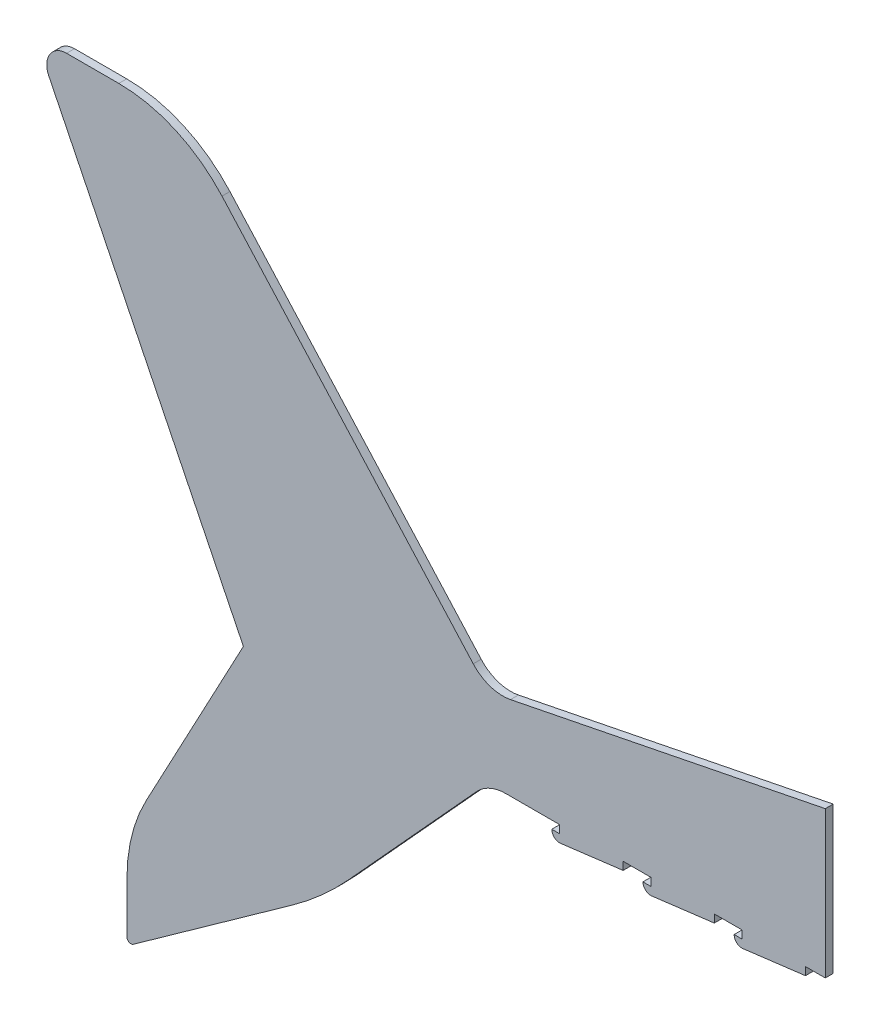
ISO-10303-21;
HEADER;
FILE_DESCRIPTION(('STEP AP214'),'2;1');
FILE_NAME('part.step','',(''),(''),'','','');
FILE_SCHEMA(('AUTOMOTIVE_DESIGN { 1 0 10303 214 1 1 1 1 }'));
ENDSEC;
DATA;
#1=APPLICATION_CONTEXT('core data for automotive mechanical design processes');
#2=APPLICATION_PROTOCOL_DEFINITION('international standard','automotive_design',2000,#1);
#3=PRODUCT_CONTEXT('',#1,'mechanical');
#4=PRODUCT('Part','Part','',(#3));
#5=PRODUCT_RELATED_PRODUCT_CATEGORY('part','',(#4));
#6=PRODUCT_DEFINITION_FORMATION('','',#4);
#7=PRODUCT_DEFINITION_CONTEXT('part definition',#1,'design');
#8=PRODUCT_DEFINITION('design','',#6,#7);
#9=PRODUCT_DEFINITION_SHAPE('','',#8);
#10=(LENGTH_UNIT() NAMED_UNIT(*) SI_UNIT(.MILLI.,.METRE.));
#11=(NAMED_UNIT(*) PLANE_ANGLE_UNIT() SI_UNIT($,.RADIAN.));
#12=(NAMED_UNIT(*) SI_UNIT($,.STERADIAN.) SOLID_ANGLE_UNIT());
#13=UNCERTAINTY_MEASURE_WITH_UNIT(LENGTH_MEASURE(1.E-05),#10,'distance_accuracy_value','');
#14=(GEOMETRIC_REPRESENTATION_CONTEXT(3) GLOBAL_UNCERTAINTY_ASSIGNED_CONTEXT((#13)) GLOBAL_UNIT_ASSIGNED_CONTEXT((#10,
#11,#12)) REPRESENTATION_CONTEXT('',''));
#15=CARTESIAN_POINT('',(0.,0.,0.));
#16=DIRECTION('',(0.,0.,1.));
#17=DIRECTION('',(1.,0.,0.));
#18=AXIS2_PLACEMENT_3D('',#15,#16,#17);
#19=CARTESIAN_POINT('',(0.,0.,2.));
#20=DIRECTION('',(0.,1.,0.));
#21=DIRECTION('',(0.,0.,1.));
#22=AXIS2_PLACEMENT_3D('',#19,#20,#21);
#23=PLANE('',#22);
#24=DIRECTION('',(0.,0.,1.));
#25=VECTOR('',#24,1.);
#26=CARTESIAN_POINT('',(-51.,0.,2.));
#27=LINE('',#26,#25);
#28=CARTESIAN_POINT('',(-51.,0.,0.));
#29=VERTEX_POINT('',#28);
#30=CARTESIAN_POINT('',(-51.,0.,2.));
#31=VERTEX_POINT('',#30);
#32=EDGE_CURVE('E318',#29,#31,#27,.T.);
#33=ORIENTED_EDGE('',*,*,#32,.F.);
#34=DIRECTION('',(1.,0.,0.));
#35=VECTOR('',#34,1.);
#36=CARTESIAN_POINT('',(0.,0.,0.));
#37=LINE('',#36,#35);
#38=CARTESIAN_POINT('',(-44.,0.,0.));
#39=VERTEX_POINT('',#38);
#40=EDGE_CURVE('E458',#29,#39,#37,.T.);
#41=ORIENTED_EDGE('',*,*,#40,.T.);
#42=DIRECTION('',(0.,0.,-1.));
#43=VECTOR('',#42,1.);
#44=CARTESIAN_POINT('',(-44.,0.,2.));
#45=LINE('',#44,#43);
#46=CARTESIAN_POINT('',(-44.,0.,2.));
#47=VERTEX_POINT('',#46);
#48=EDGE_CURVE('E343',#47,#39,#45,.T.);
#49=ORIENTED_EDGE('',*,*,#48,.F.);
#50=DIRECTION('',(1.,0.,0.));
#51=VECTOR('',#50,1.);
#52=CARTESIAN_POINT('',(0.,0.,2.));
#53=LINE('',#52,#51);
#54=EDGE_CURVE('E51',#31,#47,#53,.T.);
#55=ORIENTED_EDGE('',*,*,#54,.F.);
#56=EDGE_LOOP('',(#33,#41,#49,#55));
#57=FACE_BOUND('',#56,.T.);
#58=ADVANCED_FACE('F36',(#57),#23,.F.);
#59=DIRECTION('',(0.,0.,-1.));
#60=VECTOR('',#59,1.);
#61=CARTESIAN_POINT('',(-67.,0.,2.));
#62=LINE('',#61,#60);
#63=CARTESIAN_POINT('',(-67.,0.,2.));
#64=VERTEX_POINT('',#63);
#65=CARTESIAN_POINT('',(-67.,0.,0.));
#66=VERTEX_POINT('',#65);
#67=EDGE_CURVE('E59',#64,#66,#62,.T.);
#68=ORIENTED_EDGE('',*,*,#67,.F.);
#69=CARTESIAN_POINT('',(-80.5848116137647,0.,2.));
#70=VERTEX_POINT('',#69);
#71=EDGE_CURVE('E432',#70,#64,#53,.T.);
#72=ORIENTED_EDGE('',*,*,#71,.F.);
#73=DIRECTION('',(0.,0.,-1.));
#74=VECTOR('',#73,1.);
#75=CARTESIAN_POINT('',(-80.5848116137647,0.,0.));
#76=LINE('',#75,#74);
#77=CARTESIAN_POINT('',(-80.5848116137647,0.,0.));
#78=VERTEX_POINT('',#77);
#79=EDGE_CURVE('E467',#70,#78,#76,.T.);
#80=ORIENTED_EDGE('',*,*,#79,.T.);
#81=EDGE_CURVE('E412',#78,#66,#37,.T.);
#82=ORIENTED_EDGE('',*,*,#81,.T.);
#83=EDGE_LOOP('',(#68,#72,#80,#82));
#84=FACE_BOUND('',#83,.T.);
#85=ADVANCED_FACE('F595',(#84),#23,.F.);
#86=DIRECTION('',(0.,0.,1.));
#87=VECTOR('',#86,1.);
#88=CARTESIAN_POINT('',(-28.,0.,2.));
#89=LINE('',#88,#87);
#90=CARTESIAN_POINT('',(-28.,0.,0.));
#91=VERTEX_POINT('',#90);
#92=CARTESIAN_POINT('',(-28.,0.,2.));
#93=VERTEX_POINT('',#92);
#94=EDGE_CURVE('E338',#91,#93,#89,.T.);
#95=ORIENTED_EDGE('',*,*,#94,.F.);
#96=CARTESIAN_POINT('',(-21.,0.,0.));
#97=VERTEX_POINT('',#96);
#98=EDGE_CURVE('E631',#91,#97,#37,.T.);
#99=ORIENTED_EDGE('',*,*,#98,.T.);
#100=DIRECTION('',(0.,0.,-1.));
#101=VECTOR('',#100,1.);
#102=CARTESIAN_POINT('',(-21.,0.,2.));
#103=LINE('',#102,#101);
#104=CARTESIAN_POINT('',(-21.,0.,2.));
#105=VERTEX_POINT('',#104);
#106=EDGE_CURVE('E388',#105,#97,#103,.T.);
#107=ORIENTED_EDGE('',*,*,#106,.F.);
#108=EDGE_CURVE('E607',#93,#105,#53,.T.);
#109=ORIENTED_EDGE('',*,*,#108,.F.);
#110=EDGE_LOOP('',(#95,#99,#107,#109));
#111=FACE_BOUND('',#110,.T.);
#112=ADVANCED_FACE('F630',(#111),#23,.F.);
#113=DIRECTION('',(0.,0.,1.));
#114=VECTOR('',#113,1.);
#115=CARTESIAN_POINT('',(-5.,0.,2.));
#116=LINE('',#115,#114);
#117=CARTESIAN_POINT('',(-5.,0.,0.));
#118=VERTEX_POINT('',#117);
#119=CARTESIAN_POINT('',(-5.,0.,2.));
#120=VERTEX_POINT('',#119);
#121=EDGE_CURVE('E381',#118,#120,#116,.T.);
#122=ORIENTED_EDGE('',*,*,#121,.F.);
#123=CARTESIAN_POINT('',(0.,0.,0.));
#124=VERTEX_POINT('',#123);
#125=EDGE_CURVE('E456',#118,#124,#37,.T.);
#126=ORIENTED_EDGE('',*,*,#125,.T.);
#127=DIRECTION('',(0.,0.,-1.));
#128=VECTOR('',#127,1.);
#129=CARTESIAN_POINT('',(0.,0.,2.));
#130=LINE('',#129,#128);
#131=CARTESIAN_POINT('',(0.,0.,2.));
#132=VERTEX_POINT('',#131);
#133=EDGE_CURVE('E434',#132,#124,#130,.T.);
#134=ORIENTED_EDGE('',*,*,#133,.F.);
#135=EDGE_CURVE('E431',#120,#132,#53,.T.);
#136=ORIENTED_EDGE('',*,*,#135,.F.);
#137=EDGE_LOOP('',(#122,#126,#134,#136));
#138=FACE_BOUND('',#137,.T.);
#139=ADVANCED_FACE('F654',(#138),#23,.F.);
#140=CARTESIAN_POINT('',(0.,0.,2.));
#141=DIRECTION('',(-1.,0.,0.));
#142=DIRECTION('',(0.,0.,1.));
#143=AXIS2_PLACEMENT_3D('',#140,#141,#142);
#144=PLANE('',#143);
#145=DIRECTION('',(0.,1.,0.));
#146=VECTOR('',#145,1.);
#147=CARTESIAN_POINT('',(0.,0.,0.));
#148=LINE('',#147,#146);
#149=CARTESIAN_POINT('',(0.,37.,0.));
#150=VERTEX_POINT('',#149);
#151=EDGE_CURVE('E407',#124,#150,#148,.T.);
#152=ORIENTED_EDGE('',*,*,#151,.T.);
#153=DIRECTION('',(0.,0.,-1.));
#154=VECTOR('',#153,1.);
#155=CARTESIAN_POINT('',(0.,37.,2.));
#156=LINE('',#155,#154);
#157=CARTESIAN_POINT('',(0.,37.,2.));
#158=VERTEX_POINT('',#157);
#159=EDGE_CURVE('E464',#158,#150,#156,.T.);
#160=ORIENTED_EDGE('',*,*,#159,.F.);
#161=DIRECTION('',(0.,1.,0.));
#162=VECTOR('',#161,1.);
#163=CARTESIAN_POINT('',(0.,0.,2.));
#164=LINE('',#163,#162);
#165=EDGE_CURVE('E408',#132,#158,#164,.T.);
#166=ORIENTED_EDGE('',*,*,#165,.F.);
#167=ORIENTED_EDGE('',*,*,#133,.T.);
#168=EDGE_LOOP('',(#152,#160,#166,#167));
#169=FACE_BOUND('',#168,.T.);
#170=ADVANCED_FACE('F657',(#169),#144,.F.);
#171=CARTESIAN_POINT('',(0.,37.,2.));
#172=DIRECTION('',(0.196116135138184,-0.98058067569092,0.));
#173=DIRECTION('',(0.98058067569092,0.196116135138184,0.));
#174=AXIS2_PLACEMENT_3D('',#171,#172,#173);
#175=PLANE('',#174);
#176=DIRECTION('',(-0.98058067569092,-0.196116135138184,0.));
#177=VECTOR('',#176,1.);
#178=CARTESIAN_POINT('',(0.,37.,0.));
#179=LINE('',#178,#177);
#180=CARTESIAN_POINT('',(-79.4124927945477,21.1175014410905,0.));
#181=VERTEX_POINT('',#180);
#182=EDGE_CURVE('E437',#150,#181,#179,.T.);
#183=ORIENTED_EDGE('',*,*,#182,.T.);
#184=DIRECTION('',(0.,0.,-1.));
#185=VECTOR('',#184,1.);
#186=CARTESIAN_POINT('',(-79.4124927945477,21.1175014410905,2.));
#187=LINE('',#186,#185);
#188=CARTESIAN_POINT('',(-79.4124927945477,21.1175014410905,2.));
#189=VERTEX_POINT('',#188);
#190=EDGE_CURVE('E476',#181,#189,#187,.F.);
#191=ORIENTED_EDGE('',*,*,#190,.T.);
#192=DIRECTION('',(-0.98058067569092,-0.196116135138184,0.));
#193=VECTOR('',#192,1.);
#194=CARTESIAN_POINT('',(0.,37.,2.));
#195=LINE('',#194,#193);
#196=EDGE_CURVE('E411',#158,#189,#195,.T.);
#197=ORIENTED_EDGE('',*,*,#196,.F.);
#198=ORIENTED_EDGE('',*,*,#159,.T.);
#199=EDGE_LOOP('',(#183,#191,#197,#198));
#200=FACE_BOUND('',#199,.T.);
#201=ADVANCED_FACE('F659',(#200),#175,.F.);
#202=CARTESIAN_POINT('',(-162.616319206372,106.324126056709,2.));
#203=DIRECTION('',(-0.743616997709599,-0.668605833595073,0.));
#204=DIRECTION('',(0.668605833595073,-0.743616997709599,0.));
#205=AXIS2_PLACEMENT_3D('',#202,#203,#204);
#206=PLANE('',#205);
#207=DIRECTION('',(-0.668605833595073,0.743616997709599,0.));
#208=VECTOR('',#207,1.);
#209=CARTESIAN_POINT('',(-162.616319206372,106.324126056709,0.));
#210=LINE('',#209,#208);
#211=CARTESIAN_POINT('',(-88.8098241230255,24.2372498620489,0.));
#212=VERTEX_POINT('',#211);
#213=CARTESIAN_POINT('',(-152.187533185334,94.7253302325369,0.));
#214=VERTEX_POINT('',#213);
#215=EDGE_CURVE('E440',#212,#214,#210,.T.);
#216=ORIENTED_EDGE('',*,*,#215,.T.);
#217=DIRECTION('',(0.,0.,-1.));
#218=VECTOR('',#217,1.);
#219=CARTESIAN_POINT('',(-152.187533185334,94.7253302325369,2.));
#220=LINE('',#219,#218);
#221=CARTESIAN_POINT('',(-152.187533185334,94.7253302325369,2.));
#222=VERTEX_POINT('',#221);
#223=EDGE_CURVE('E44',#214,#222,#220,.F.);
#224=ORIENTED_EDGE('',*,*,#223,.T.);
#225=DIRECTION('',(-0.668605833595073,0.743616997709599,0.));
#226=VECTOR('',#225,1.);
#227=CARTESIAN_POINT('',(-162.616319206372,106.324126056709,2.));
#228=LINE('',#227,#226);
#229=CARTESIAN_POINT('',(-88.8098241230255,24.2372498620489,2.));
#230=VERTEX_POINT('',#229);
#231=EDGE_CURVE('E415',#230,#222,#228,.T.);
#232=ORIENTED_EDGE('',*,*,#231,.F.);
#233=DIRECTION('',(0.,0.,-1.));
#234=VECTOR('',#233,1.);
#235=CARTESIAN_POINT('',(-88.8098241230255,24.2372498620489,0.));
#236=LINE('',#235,#234);
#237=EDGE_CURVE('E473',#230,#212,#236,.T.);
#238=ORIENTED_EDGE('',*,*,#237,.T.);
#239=EDGE_LOOP('',(#216,#224,#232,#238));
#240=FACE_BOUND('',#239,.T.);
#241=ADVANCED_FACE('F536',(#240),#206,.F.);
#242=CARTESIAN_POINT('',(-199.407639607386,106.324126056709,2.));
#243=DIRECTION('',(0.,-1.,0.));
#244=DIRECTION('',(0.,0.,-1.));
#245=AXIS2_PLACEMENT_3D('',#242,#243,#244);
#246=PLANE('',#245);
#247=DIRECTION('',(-1.,0.,0.));
#248=VECTOR('',#247,1.);
#249=CARTESIAN_POINT('',(-199.407639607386,106.324126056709,2.));
#250=LINE('',#249,#248);
#251=CARTESIAN_POINT('',(-178.21412810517,106.324126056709,2.));
#252=VERTEX_POINT('',#251);
#253=CARTESIAN_POINT('',(-191.386050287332,106.324126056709,2.));
#254=VERTEX_POINT('',#253);
#255=EDGE_CURVE('E418',#252,#254,#250,.T.);
#256=ORIENTED_EDGE('',*,*,#255,.F.);
#257=DIRECTION('',(0.,0.,-1.));
#258=VECTOR('',#257,1.);
#259=CARTESIAN_POINT('',(-178.21412810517,106.324126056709,2.));
#260=LINE('',#259,#258);
#261=CARTESIAN_POINT('',(-178.21412810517,106.324126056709,0.));
#262=VERTEX_POINT('',#261);
#263=EDGE_CURVE('E529',#252,#262,#260,.T.);
#264=ORIENTED_EDGE('',*,*,#263,.T.);
#265=DIRECTION('',(-1.,0.,0.));
#266=VECTOR('',#265,1.);
#267=CARTESIAN_POINT('',(-199.407639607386,106.324126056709,0.));
#268=LINE('',#267,#266);
#269=CARTESIAN_POINT('',(-191.386050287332,106.324126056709,0.));
#270=VERTEX_POINT('',#269);
#271=EDGE_CURVE('E443',#262,#270,#268,.T.);
#272=ORIENTED_EDGE('',*,*,#271,.T.);
#273=DIRECTION('',(0.,0.,-1.));
#274=VECTOR('',#273,1.);
#275=CARTESIAN_POINT('',(-191.386050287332,106.324126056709,2.));
#276=LINE('',#275,#274);
#277=EDGE_CURVE('E524',#270,#254,#276,.F.);
#278=ORIENTED_EDGE('',*,*,#277,.T.);
#279=EDGE_LOOP('',(#256,#264,#272,#278));
#280=FACE_BOUND('',#279,.T.);
#281=ADVANCED_FACE('F547',(#280),#246,.F.);
#282=CARTESIAN_POINT('',(-146.787475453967,-0.954497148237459,2.));
#283=DIRECTION('',(0.897812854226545,0.440377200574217,0.));
#284=DIRECTION('',(-0.440377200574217,0.897812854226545,0.));
#285=AXIS2_PLACEMENT_3D('',#282,#283,#284);
#286=PLANE('',#285);
#287=DIRECTION('',(0.440377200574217,-0.897812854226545,0.));
#288=VECTOR('',#287,1.);
#289=CARTESIAN_POINT('',(-146.787475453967,-0.954497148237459,2.));
#290=LINE('',#289,#288);
#291=CARTESIAN_POINT('',(-195.875114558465,99.1222400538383,2.));
#292=VERTEX_POINT('',#291);
#293=CARTESIAN_POINT('',(-146.787475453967,-0.954497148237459,2.));
#294=VERTEX_POINT('',#293);
#295=EDGE_CURVE('E420',#292,#294,#290,.T.);
#296=ORIENTED_EDGE('',*,*,#295,.F.);
#297=DIRECTION('',(0.,0.,-1.));
#298=VECTOR('',#297,1.);
#299=CARTESIAN_POINT('',(-195.875114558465,99.1222400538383,2.));
#300=LINE('',#299,#298);
#301=CARTESIAN_POINT('',(-195.875114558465,99.1222400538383,0.));
#302=VERTEX_POINT('',#301);
#303=EDGE_CURVE('E518',#292,#302,#300,.T.);
#304=ORIENTED_EDGE('',*,*,#303,.T.);
#305=DIRECTION('',(0.440377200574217,-0.897812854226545,0.));
#306=VECTOR('',#305,1.);
#307=CARTESIAN_POINT('',(-146.787475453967,-0.954497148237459,0.));
#308=LINE('',#307,#306);
#309=CARTESIAN_POINT('',(-146.787475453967,-0.954497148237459,0.));
#310=VERTEX_POINT('',#309);
#311=EDGE_CURVE('E445',#302,#310,#308,.T.);
#312=ORIENTED_EDGE('',*,*,#311,.T.);
#313=DIRECTION('',(0.,0.,-1.));
#314=VECTOR('',#313,1.);
#315=CARTESIAN_POINT('',(-146.787475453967,-0.954497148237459,2.));
#316=LINE('',#315,#314);
#317=EDGE_CURVE('E461',#294,#310,#316,.T.);
#318=ORIENTED_EDGE('',*,*,#317,.F.);
#319=EDGE_LOOP('',(#296,#304,#312,#318));
#320=FACE_BOUND('',#319,.T.);
#321=ADVANCED_FACE('F558',(#320),#286,.F.);
#322=CARTESIAN_POINT('',(-176.155561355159,-55.9797070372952,2.));
#323=DIRECTION('',(0.882211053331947,-0.470854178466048,0.));
#324=DIRECTION('',(0.470854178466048,0.882211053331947,0.));
#325=AXIS2_PLACEMENT_3D('',#322,#323,#324);
#326=PLANE('',#325);
#327=DIRECTION('',(-0.470854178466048,-0.882211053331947,0.));
#328=VECTOR('',#327,1.);
#329=CARTESIAN_POINT('',(-176.155561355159,-55.9797070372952,0.));
#330=LINE('',#329,#328);
#331=CARTESIAN_POINT('',(-171.326214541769,-46.9312514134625,0.));
#332=VERTEX_POINT('',#331);
#333=EDGE_CURVE('E447',#310,#332,#330,.T.);
#334=ORIENTED_EDGE('',*,*,#333,.T.);
#335=DIRECTION('',(0.,0.,-1.));
#336=VECTOR('',#335,1.);
#337=CARTESIAN_POINT('',(-171.326214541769,-46.9312514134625,2.));
#338=LINE('',#337,#336);
#339=CARTESIAN_POINT('',(-171.326214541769,-46.9312514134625,2.));
#340=VERTEX_POINT('',#339);
#341=EDGE_CURVE('E514',#332,#340,#338,.F.);
#342=ORIENTED_EDGE('',*,*,#341,.T.);
#343=DIRECTION('',(-0.470854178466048,-0.882211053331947,0.));
#344=VECTOR('',#343,1.);
#345=CARTESIAN_POINT('',(-176.155561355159,-55.9797070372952,2.));
#346=LINE('',#345,#344);
#347=EDGE_CURVE('E422',#294,#340,#346,.T.);
#348=ORIENTED_EDGE('',*,*,#347,.F.);
#349=ORIENTED_EDGE('',*,*,#317,.T.);
#350=EDGE_LOOP('',(#334,#342,#348,#349));
#351=FACE_BOUND('',#350,.T.);
#352=ADVANCED_FACE('F561',(#351),#326,.F.);
#353=CARTESIAN_POINT('',(-176.155561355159,-81.0576783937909,2.));
#354=DIRECTION('',(1.,0.,0.));
#355=DIRECTION('',(0.,0.,-1.));
#356=AXIS2_PLACEMENT_3D('',#353,#354,#355);
#357=PLANE('',#356);
#358=DIRECTION('',(0.,-1.,0.));
#359=VECTOR('',#358,1.);
#360=CARTESIAN_POINT('',(-176.155561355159,-81.0576783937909,2.));
#361=LINE('',#360,#359);
#362=CARTESIAN_POINT('',(-176.155561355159,-66.2362727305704,2.));
#363=VERTEX_POINT('',#362);
#364=CARTESIAN_POINT('',(-176.155561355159,-79.1155731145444,2.));
#365=VERTEX_POINT('',#364);
#366=EDGE_CURVE('E425',#363,#365,#361,.T.);
#367=ORIENTED_EDGE('',*,*,#366,.F.);
#368=DIRECTION('',(0.,0.,-1.));
#369=VECTOR('',#368,1.);
#370=CARTESIAN_POINT('',(-176.155561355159,-66.2362727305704,2.));
#371=LINE('',#370,#369);
#372=CARTESIAN_POINT('',(-176.155561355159,-66.2362727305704,0.));
#373=VERTEX_POINT('',#372);
#374=EDGE_CURVE('E509',#363,#373,#371,.T.);
#375=ORIENTED_EDGE('',*,*,#374,.T.);
#376=DIRECTION('',(0.,-1.,0.));
#377=VECTOR('',#376,1.);
#378=CARTESIAN_POINT('',(-176.155561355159,-81.0576783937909,0.));
#379=LINE('',#378,#377);
#380=CARTESIAN_POINT('',(-176.155561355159,-79.1155731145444,0.));
#381=VERTEX_POINT('',#380);
#382=EDGE_CURVE('E450',#373,#381,#379,.T.);
#383=ORIENTED_EDGE('',*,*,#382,.T.);
#384=DIRECTION('',(0.,0.,-1.));
#385=VECTOR('',#384,1.);
#386=CARTESIAN_POINT('',(-176.155561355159,-79.1155731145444,2.));
#387=LINE('',#386,#385);
#388=EDGE_CURVE('E504',#381,#365,#387,.F.);
#389=ORIENTED_EDGE('',*,*,#388,.T.);
#390=EDGE_LOOP('',(#367,#375,#383,#389));
#391=FACE_BOUND('',#390,.T.);
#392=ADVANCED_FACE('F570',(#391),#357,.F.);
#393=CARTESIAN_POINT('',(-126.770997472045,-45.8168502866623,2.));
#394=DIRECTION('',(-0.58086857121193,0.813997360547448,0.));
#395=DIRECTION('',(-0.813997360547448,-0.58086857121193,0.));
#396=AXIS2_PLACEMENT_3D('',#393,#394,#395);
#397=PLANE('',#396);
#398=DIRECTION('',(0.813997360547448,0.58086857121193,0.));
#399=VECTOR('',#398,1.);
#400=CARTESIAN_POINT('',(-126.770997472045,-45.8168502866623,2.));
#401=LINE('',#400,#399);
#402=CARTESIAN_POINT('',(-174.574692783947,-79.9295704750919,2.));
#403=VERTEX_POINT('',#402);
#404=CARTESIAN_POINT('',(-134.556930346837,-51.3728925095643,2.));
#405=VERTEX_POINT('',#404);
#406=EDGE_CURVE('E427',#403,#405,#401,.T.);
#407=ORIENTED_EDGE('',*,*,#406,.F.);
#408=DIRECTION('',(0.,0.,-1.));
#409=VECTOR('',#408,1.);
#410=CARTESIAN_POINT('',(-174.574692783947,-79.9295704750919,2.));
#411=LINE('',#410,#409);
#412=CARTESIAN_POINT('',(-174.574692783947,-79.9295704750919,0.));
#413=VERTEX_POINT('',#412);
#414=EDGE_CURVE('E498',#403,#413,#411,.T.);
#415=ORIENTED_EDGE('',*,*,#414,.T.);
#416=DIRECTION('',(0.813997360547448,0.58086857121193,0.));
#417=VECTOR('',#416,1.);
#418=CARTESIAN_POINT('',(-126.770997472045,-45.8168502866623,0.));
#419=LINE('',#418,#417);
#420=CARTESIAN_POINT('',(-134.556930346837,-51.3728925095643,0.));
#421=VERTEX_POINT('',#420);
#422=EDGE_CURVE('E452',#413,#421,#419,.T.);
#423=ORIENTED_EDGE('',*,*,#422,.T.);
#424=DIRECTION('',(0.,0.,-1.));
#425=VECTOR('',#424,1.);
#426=CARTESIAN_POINT('',(-134.556930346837,-51.3728925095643,2.));
#427=LINE('',#426,#425);
#428=EDGE_CURVE('E493',#421,#405,#427,.F.);
#429=ORIENTED_EDGE('',*,*,#428,.T.);
#430=EDGE_LOOP('',(#407,#415,#423,#429));
#431=FACE_BOUND('',#430,.T.);
#432=ADVANCED_FACE('F579',(#431),#397,.F.);
#433=CARTESIAN_POINT('',(-85.,0.,2.));
#434=DIRECTION('',(-0.738981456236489,0.673725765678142,0.));
#435=DIRECTION('',(-0.673725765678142,-0.738981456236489,0.));
#436=AXIS2_PLACEMENT_3D('',#433,#434,#435);
#437=PLANE('',#436);
#438=DIRECTION('',(0.673725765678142,0.738981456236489,0.));
#439=VECTOR('',#438,1.);
#440=CARTESIAN_POINT('',(-85.,0.,2.));
#441=LINE('',#440,#439);
#442=CARTESIAN_POINT('',(-120.326770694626,-38.7484489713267,2.));
#443=VERTEX_POINT('',#442);
#444=CARTESIAN_POINT('',(-87.9746261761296,-3.26274234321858,2.));
#445=VERTEX_POINT('',#444);
#446=EDGE_CURVE('E429',#443,#445,#441,.T.);
#447=ORIENTED_EDGE('',*,*,#446,.F.);
#448=DIRECTION('',(0.,0.,-1.));
#449=VECTOR('',#448,1.);
#450=CARTESIAN_POINT('',(-120.326770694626,-38.7484489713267,2.));
#451=LINE('',#450,#449);
#452=CARTESIAN_POINT('',(-120.326770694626,-38.7484489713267,0.));
#453=VERTEX_POINT('',#452);
#454=EDGE_CURVE('E487',#443,#453,#451,.T.);
#455=ORIENTED_EDGE('',*,*,#454,.T.);
#456=DIRECTION('',(0.673725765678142,0.738981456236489,0.));
#457=VECTOR('',#456,1.);
#458=CARTESIAN_POINT('',(-85.,0.,0.));
#459=LINE('',#458,#457);
#460=CARTESIAN_POINT('',(-87.9746261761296,-3.26274234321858,0.));
#461=VERTEX_POINT('',#460);
#462=EDGE_CURVE('E454',#453,#461,#459,.T.);
#463=ORIENTED_EDGE('',*,*,#462,.T.);
#464=DIRECTION('',(0.,0.,-1.));
#465=VECTOR('',#464,1.);
#466=CARTESIAN_POINT('',(-87.9746261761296,-3.26274234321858,2.));
#467=LINE('',#466,#465);
#468=EDGE_CURVE('E470',#461,#445,#467,.F.);
#469=ORIENTED_EDGE('',*,*,#468,.T.);
#470=EDGE_LOOP('',(#447,#455,#463,#469));
#471=FACE_BOUND('',#470,.T.);
#472=ADVANCED_FACE('F587',(#471),#437,.F.);
#473=CARTESIAN_POINT('',(0.,0.,2.));
#474=DIRECTION('',(0.,0.,-1.));
#475=DIRECTION('',(-1.,0.,0.));
#476=AXIS2_PLACEMENT_3D('',#473,#474,#475);
#477=PLANE('',#476);
#478=ORIENTED_EDGE('',*,*,#231,.T.);
#479=CARTESIAN_POINT('',(-178.21412810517,71.3241260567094,2.));
#480=DIRECTION('',(0.,0.,-1.));
#481=DIRECTION('',(-1.,0.,0.));
#482=AXIS2_PLACEMENT_3D('',#479,#480,#481);
#483=CIRCLE('',#482,35.);
#484=EDGE_CURVE('E11',#222,#252,#483,.F.);
#485=ORIENTED_EDGE('',*,*,#484,.T.);
#486=ORIENTED_EDGE('',*,*,#255,.T.);
#487=CARTESIAN_POINT('',(-191.386050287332,101.324126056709,2.));
#488=DIRECTION('',(0.,0.,-1.));
#489=DIRECTION('',(-1.,0.,0.));
#490=AXIS2_PLACEMENT_3D('',#487,#488,#489);
#491=CIRCLE('',#490,5.);
#492=EDGE_CURVE('E527',#254,#292,#491,.F.);
#493=ORIENTED_EDGE('',*,*,#492,.T.);
#494=ORIENTED_EDGE('',*,*,#295,.T.);
#495=ORIENTED_EDGE('',*,*,#347,.T.);
#496=CARTESIAN_POINT('',(-135.155561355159,-66.2362727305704,2.));
#497=DIRECTION('',(0.,0.,-1.));
#498=DIRECTION('',(-1.,0.,0.));
#499=AXIS2_PLACEMENT_3D('',#496,#497,#498);
#500=CIRCLE('',#499,41.);
#501=EDGE_CURVE('E516',#340,#363,#500,.F.);
#502=ORIENTED_EDGE('',*,*,#501,.T.);
#503=ORIENTED_EDGE('',*,*,#366,.T.);
#504=CARTESIAN_POINT('',(-175.155561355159,-79.1155731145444,2.));
#505=DIRECTION('',(0.,0.,-1.));
#506=DIRECTION('',(-1.,0.,0.));
#507=AXIS2_PLACEMENT_3D('',#504,#505,#506);
#508=CIRCLE('',#507,1.);
#509=EDGE_CURVE('E507',#365,#403,#508,.F.);
#510=ORIENTED_EDGE('',*,*,#509,.T.);
#511=ORIENTED_EDGE('',*,*,#406,.T.);
#512=CARTESIAN_POINT('',(-186.83510175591,21.886869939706,2.));
#513=DIRECTION('',(0.,0.,-1.));
#514=DIRECTION('',(-1.,0.,0.));
#515=AXIS2_PLACEMENT_3D('',#512,#513,#514);
#516=CIRCLE('',#515,90.);
#517=EDGE_CURVE('E496',#405,#443,#516,.F.);
#518=ORIENTED_EDGE('',*,*,#517,.T.);
#519=ORIENTED_EDGE('',*,*,#446,.T.);
#520=CARTESIAN_POINT('',(-80.5848116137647,-10.,2.));
#521=DIRECTION('',(0.,0.,-1.));
#522=DIRECTION('',(-1.,0.,0.));
#523=AXIS2_PLACEMENT_3D('',#520,#521,#522);
#524=CIRCLE('',#523,10.);
#525=EDGE_CURVE('E481',#445,#70,#524,.T.);
#526=ORIENTED_EDGE('',*,*,#525,.T.);
#527=ORIENTED_EDGE('',*,*,#71,.T.);
#528=DIRECTION('',(0.,1.,0.));
#529=VECTOR('',#528,1.);
#530=CARTESIAN_POINT('',(-67.,-2.,2.));
#531=LINE('',#530,#529);
#532=CARTESIAN_POINT('',(-67.,-2.,2.));
#533=VERTEX_POINT('',#532);
#534=EDGE_CURVE('E333',#533,#64,#531,.T.);
#535=ORIENTED_EDGE('',*,*,#534,.F.);
#536=DIRECTION('',(-1.,0.,0.));
#537=VECTOR('',#536,1.);
#538=CARTESIAN_POINT('',(-46.,-2.,2.));
#539=LINE('',#538,#537);
#540=CARTESIAN_POINT('',(-69.,-2.,2.));
#541=VERTEX_POINT('',#540);
#542=EDGE_CURVE('E293',#533,#541,#539,.T.);
#543=ORIENTED_EDGE('',*,*,#542,.T.);
#544=CARTESIAN_POINT('',(-67.,-2.,2.));
#545=DIRECTION('',(0.,0.,1.));
#546=DIRECTION('',(1.,0.,0.));
#547=AXIS2_PLACEMENT_3D('',#544,#545,#546);
#548=CIRCLE('',#547,2.);
#549=CARTESIAN_POINT('',(-67.,-4.,2.));
#550=VERTEX_POINT('',#549);
#551=EDGE_CURVE('E283',#541,#550,#548,.T.);
#552=ORIENTED_EDGE('',*,*,#551,.T.);
#553=DIRECTION('',(0.992277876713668,0.124034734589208,0.));
#554=VECTOR('',#553,1.);
#555=CARTESIAN_POINT('',(-45.8307692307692,-1.35384615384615,2.));
#556=LINE('',#555,#554);
#557=CARTESIAN_POINT('',(-51.,-2.,2.));
#558=VERTEX_POINT('',#557);
#559=EDGE_CURVE('E276',#550,#558,#556,.T.);
#560=ORIENTED_EDGE('',*,*,#559,.T.);
#561=DIRECTION('',(0.,1.,0.));
#562=VECTOR('',#561,1.);
#563=CARTESIAN_POINT('',(-51.,-2.,2.));
#564=LINE('',#563,#562);
#565=EDGE_CURVE('E336',#558,#31,#564,.T.);
#566=ORIENTED_EDGE('',*,*,#565,.T.);
#567=ORIENTED_EDGE('',*,*,#54,.T.);
#568=DIRECTION('',(0.,1.,0.));
#569=VECTOR('',#568,1.);
#570=CARTESIAN_POINT('',(-44.,-2.,2.));
#571=LINE('',#570,#569);
#572=CARTESIAN_POINT('',(-44.,-2.,2.));
#573=VERTEX_POINT('',#572);
#574=EDGE_CURVE('E356',#573,#47,#571,.T.);
#575=ORIENTED_EDGE('',*,*,#574,.F.);
#576=DIRECTION('',(-1.,0.,0.));
#577=VECTOR('',#576,1.);
#578=CARTESIAN_POINT('',(-23.,-2.,2.));
#579=LINE('',#578,#577);
#580=CARTESIAN_POINT('',(-46.,-2.,2.));
#581=VERTEX_POINT('',#580);
#582=EDGE_CURVE('E298',#573,#581,#579,.T.);
#583=ORIENTED_EDGE('',*,*,#582,.T.);
#584=CARTESIAN_POINT('',(-44.,-2.,2.));
#585=DIRECTION('',(0.,0.,1.));
#586=DIRECTION('',(1.,0.,0.));
#587=AXIS2_PLACEMENT_3D('',#584,#585,#586);
#588=CIRCLE('',#587,2.);
#589=CARTESIAN_POINT('',(-44.,-4.,2.));
#590=VERTEX_POINT('',#589);
#591=EDGE_CURVE('E311',#581,#590,#588,.T.);
#592=ORIENTED_EDGE('',*,*,#591,.T.);
#593=DIRECTION('',(0.992277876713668,0.124034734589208,0.));
#594=VECTOR('',#593,1.);
#595=CARTESIAN_POINT('',(-22.8307692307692,-1.35384615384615,2.));
#596=LINE('',#595,#594);
#597=CARTESIAN_POINT('',(-28.,-2.,2.));
#598=VERTEX_POINT('',#597);
#599=EDGE_CURVE('E303',#590,#598,#596,.T.);
#600=ORIENTED_EDGE('',*,*,#599,.T.);
#601=DIRECTION('',(0.,1.,0.));
#602=VECTOR('',#601,1.);
#603=CARTESIAN_POINT('',(-28.,-2.,2.));
#604=LINE('',#603,#602);
#605=EDGE_CURVE('E359',#598,#93,#604,.T.);
#606=ORIENTED_EDGE('',*,*,#605,.T.);
#607=ORIENTED_EDGE('',*,*,#108,.T.);
#608=DIRECTION('',(0.,1.,0.));
#609=VECTOR('',#608,1.);
#610=CARTESIAN_POINT('',(-21.,-2.,2.));
#611=LINE('',#610,#609);
#612=CARTESIAN_POINT('',(-21.,-2.,2.));
#613=VERTEX_POINT('',#612);
#614=EDGE_CURVE('E401',#613,#105,#611,.T.);
#615=ORIENTED_EDGE('',*,*,#614,.F.);
#616=DIRECTION('',(-1.,0.,0.));
#617=VECTOR('',#616,1.);
#618=CARTESIAN_POINT('',(0.,-2.,2.));
#619=LINE('',#618,#617);
#620=CARTESIAN_POINT('',(-23.,-2.,2.));
#621=VERTEX_POINT('',#620);
#622=EDGE_CURVE('E362',#613,#621,#619,.T.);
#623=ORIENTED_EDGE('',*,*,#622,.T.);
#624=CARTESIAN_POINT('',(-21.,-2.,2.));
#625=DIRECTION('',(0.,0.,1.));
#626=DIRECTION('',(1.,0.,0.));
#627=AXIS2_PLACEMENT_3D('',#624,#625,#626);
#628=CIRCLE('',#627,2.);
#629=CARTESIAN_POINT('',(-21.,-4.,2.));
#630=VERTEX_POINT('',#629);
#631=EDGE_CURVE('E374',#621,#630,#628,.T.);
#632=ORIENTED_EDGE('',*,*,#631,.T.);
#633=DIRECTION('',(0.992277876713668,0.124034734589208,0.));
#634=VECTOR('',#633,1.);
#635=CARTESIAN_POINT('',(0.169230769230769,-1.35384615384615,2.));
#636=LINE('',#635,#634);
#637=CARTESIAN_POINT('',(-5.,-2.,2.));
#638=VERTEX_POINT('',#637);
#639=EDGE_CURVE('E366',#630,#638,#636,.T.);
#640=ORIENTED_EDGE('',*,*,#639,.T.);
#641=DIRECTION('',(0.,1.,0.));
#642=VECTOR('',#641,1.);
#643=CARTESIAN_POINT('',(-5.,-2.,2.));
#644=LINE('',#643,#642);
#645=EDGE_CURVE('E404',#638,#120,#644,.T.);
#646=ORIENTED_EDGE('',*,*,#645,.T.);
#647=ORIENTED_EDGE('',*,*,#135,.T.);
#648=ORIENTED_EDGE('',*,*,#165,.T.);
#649=ORIENTED_EDGE('',*,*,#196,.T.);
#650=CARTESIAN_POINT('',(-81.3736541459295,30.9233081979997,2.));
#651=DIRECTION('',(0.,0.,-1.));
#652=DIRECTION('',(-1.,0.,0.));
#653=AXIS2_PLACEMENT_3D('',#650,#651,#652);
#654=CIRCLE('',#653,10.);
#655=EDGE_CURVE('E485',#189,#230,#654,.T.);
#656=ORIENTED_EDGE('',*,*,#655,.T.);
#657=EDGE_LOOP('',(#478,#485,#486,#493,#494,#495,#502,#503,#510,#511,#518,#519,#526,#527,#535,
#543,#552,#560,#566,#567,#575,#583,#592,#600,#606,#607,#615,#623,#632,#640,#646,#647,#648,#649,#656));
#658=FACE_BOUND('',#657,.T.);
#659=ADVANCED_FACE('F542',(#658),#477,.F.);
#660=CARTESIAN_POINT('',(0.,0.,0.));
#661=DIRECTION('',(0.,0.,-1.));
#662=DIRECTION('',(-1.,0.,0.));
#663=AXIS2_PLACEMENT_3D('',#660,#661,#662);
#664=PLANE('',#663);
#665=ORIENTED_EDGE('',*,*,#271,.F.);
#666=CARTESIAN_POINT('',(-178.21412810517,71.3241260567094,0.));
#667=DIRECTION('',(0.,0.,-1.));
#668=DIRECTION('',(-1.,0.,0.));
#669=AXIS2_PLACEMENT_3D('',#666,#667,#668);
#670=CIRCLE('',#669,35.);
#671=EDGE_CURVE('E532',#262,#214,#670,.T.);
#672=ORIENTED_EDGE('',*,*,#671,.T.);
#673=ORIENTED_EDGE('',*,*,#215,.F.);
#674=CARTESIAN_POINT('',(-81.3736541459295,30.9233081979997,0.));
#675=DIRECTION('',(0.,0.,-1.));
#676=DIRECTION('',(-1.,0.,0.));
#677=AXIS2_PLACEMENT_3D('',#674,#675,#676);
#678=CIRCLE('',#677,10.);
#679=EDGE_CURVE('E483',#212,#181,#678,.F.);
#680=ORIENTED_EDGE('',*,*,#679,.T.);
#681=ORIENTED_EDGE('',*,*,#182,.F.);
#682=ORIENTED_EDGE('',*,*,#151,.F.);
#683=ORIENTED_EDGE('',*,*,#125,.F.);
#684=DIRECTION('',(0.,1.,0.));
#685=VECTOR('',#684,1.);
#686=CARTESIAN_POINT('',(-5.,-2.,0.));
#687=LINE('',#686,#685);
#688=CARTESIAN_POINT('',(-5.,-2.,0.));
#689=VERTEX_POINT('',#688);
#690=EDGE_CURVE('E391',#689,#118,#687,.T.);
#691=ORIENTED_EDGE('',*,*,#690,.F.);
#692=DIRECTION('',(0.992277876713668,0.124034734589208,0.));
#693=VECTOR('',#692,1.);
#694=CARTESIAN_POINT('',(0.169230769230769,-1.35384615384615,0.));
#695=LINE('',#694,#693);
#696=CARTESIAN_POINT('',(-21.,-4.,0.));
#697=VERTEX_POINT('',#696);
#698=EDGE_CURVE('E369',#697,#689,#695,.T.);
#699=ORIENTED_EDGE('',*,*,#698,.F.);
#700=CARTESIAN_POINT('',(-21.,-2.,0.));
#701=DIRECTION('',(0.,0.,1.));
#702=DIRECTION('',(1.,0.,0.));
#703=AXIS2_PLACEMENT_3D('',#700,#701,#702);
#704=CIRCLE('',#703,2.);
#705=CARTESIAN_POINT('',(-23.,-2.,0.));
#706=VERTEX_POINT('',#705);
#707=EDGE_CURVE('E365',#706,#697,#704,.T.);
#708=ORIENTED_EDGE('',*,*,#707,.F.);
#709=DIRECTION('',(-1.,0.,0.));
#710=VECTOR('',#709,1.);
#711=CARTESIAN_POINT('',(0.,-2.,0.));
#712=LINE('',#711,#710);
#713=CARTESIAN_POINT('',(-21.,-2.,0.));
#714=VERTEX_POINT('',#713);
#715=EDGE_CURVE('E363',#714,#706,#712,.T.);
#716=ORIENTED_EDGE('',*,*,#715,.F.);
#717=DIRECTION('',(0.,1.,0.));
#718=VECTOR('',#717,1.);
#719=CARTESIAN_POINT('',(-21.,-2.,0.));
#720=LINE('',#719,#718);
#721=EDGE_CURVE('E398',#714,#97,#720,.T.);
#722=ORIENTED_EDGE('',*,*,#721,.T.);
#723=ORIENTED_EDGE('',*,*,#98,.F.);
#724=DIRECTION('',(0.,1.,0.));
#725=VECTOR('',#724,1.);
#726=CARTESIAN_POINT('',(-28.,-2.,0.));
#727=LINE('',#726,#725);
#728=CARTESIAN_POINT('',(-28.,-2.,0.));
#729=VERTEX_POINT('',#728);
#730=EDGE_CURVE('E346',#729,#91,#727,.T.);
#731=ORIENTED_EDGE('',*,*,#730,.F.);
#732=DIRECTION('',(0.992277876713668,0.124034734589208,0.));
#733=VECTOR('',#732,1.);
#734=CARTESIAN_POINT('',(-22.8307692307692,-1.35384615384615,0.));
#735=LINE('',#734,#733);
#736=CARTESIAN_POINT('',(-44.,-4.,0.));
#737=VERTEX_POINT('',#736);
#738=EDGE_CURVE('E306',#737,#729,#735,.T.);
#739=ORIENTED_EDGE('',*,*,#738,.F.);
#740=CARTESIAN_POINT('',(-44.,-2.,0.));
#741=DIRECTION('',(0.,0.,1.));
#742=DIRECTION('',(1.,0.,0.));
#743=AXIS2_PLACEMENT_3D('',#740,#741,#742);
#744=CIRCLE('',#743,2.);
#745=CARTESIAN_POINT('',(-46.,-2.,0.));
#746=VERTEX_POINT('',#745);
#747=EDGE_CURVE('E302',#746,#737,#744,.T.);
#748=ORIENTED_EDGE('',*,*,#747,.F.);
#749=DIRECTION('',(-1.,0.,0.));
#750=VECTOR('',#749,1.);
#751=CARTESIAN_POINT('',(-23.,-2.,0.));
#752=LINE('',#751,#750);
#753=CARTESIAN_POINT('',(-44.,-2.,0.));
#754=VERTEX_POINT('',#753);
#755=EDGE_CURVE('E300',#754,#746,#752,.T.);
#756=ORIENTED_EDGE('',*,*,#755,.F.);
#757=DIRECTION('',(0.,1.,0.));
#758=VECTOR('',#757,1.);
#759=CARTESIAN_POINT('',(-44.,-2.,0.));
#760=LINE('',#759,#758);
#761=EDGE_CURVE('E353',#754,#39,#760,.T.);
#762=ORIENTED_EDGE('',*,*,#761,.T.);
#763=ORIENTED_EDGE('',*,*,#40,.F.);
#764=DIRECTION('',(0.,1.,0.));
#765=VECTOR('',#764,1.);
#766=CARTESIAN_POINT('',(-51.,-2.,0.));
#767=LINE('',#766,#765);
#768=CARTESIAN_POINT('',(-51.,-2.,0.));
#769=VERTEX_POINT('',#768);
#770=EDGE_CURVE('E325',#769,#29,#767,.T.);
#771=ORIENTED_EDGE('',*,*,#770,.F.);
#772=DIRECTION('',(0.992277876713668,0.124034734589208,0.));
#773=VECTOR('',#772,1.);
#774=CARTESIAN_POINT('',(-45.8307692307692,-1.35384615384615,0.));
#775=LINE('',#774,#773);
#776=CARTESIAN_POINT('',(-67.,-4.,0.));
#777=VERTEX_POINT('',#776);
#778=EDGE_CURVE('E285',#777,#769,#775,.T.);
#779=ORIENTED_EDGE('',*,*,#778,.F.);
#780=CARTESIAN_POINT('',(-67.,-2.,0.));
#781=DIRECTION('',(0.,0.,1.));
#782=DIRECTION('',(1.,0.,0.));
#783=AXIS2_PLACEMENT_3D('',#780,#781,#782);
#784=CIRCLE('',#783,2.);
#785=CARTESIAN_POINT('',(-69.,-2.,0.));
#786=VERTEX_POINT('',#785);
#787=EDGE_CURVE('E275',#786,#777,#784,.T.);
#788=ORIENTED_EDGE('',*,*,#787,.F.);
#789=DIRECTION('',(-1.,0.,0.));
#790=VECTOR('',#789,1.);
#791=CARTESIAN_POINT('',(-46.,-2.,0.));
#792=LINE('',#791,#790);
#793=CARTESIAN_POINT('',(-67.,-2.,0.));
#794=VERTEX_POINT('',#793);
#795=EDGE_CURVE('E265',#794,#786,#792,.T.);
#796=ORIENTED_EDGE('',*,*,#795,.F.);
#797=DIRECTION('',(0.,1.,0.));
#798=VECTOR('',#797,1.);
#799=CARTESIAN_POINT('',(-67.,-2.,0.));
#800=LINE('',#799,#798);
#801=EDGE_CURVE('E331',#794,#66,#800,.T.);
#802=ORIENTED_EDGE('',*,*,#801,.T.);
#803=ORIENTED_EDGE('',*,*,#81,.F.);
#804=CARTESIAN_POINT('',(-80.5848116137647,-10.,0.));
#805=DIRECTION('',(0.,0.,-1.));
#806=DIRECTION('',(-1.,0.,0.));
#807=AXIS2_PLACEMENT_3D('',#804,#805,#806);
#808=CIRCLE('',#807,10.);
#809=EDGE_CURVE('E478',#78,#461,#808,.F.);
#810=ORIENTED_EDGE('',*,*,#809,.T.);
#811=ORIENTED_EDGE('',*,*,#462,.F.);
#812=CARTESIAN_POINT('',(-186.83510175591,21.886869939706,0.));
#813=DIRECTION('',(0.,0.,-1.));
#814=DIRECTION('',(-1.,0.,0.));
#815=AXIS2_PLACEMENT_3D('',#812,#813,#814);
#816=CIRCLE('',#815,90.);
#817=EDGE_CURVE('E490',#453,#421,#816,.T.);
#818=ORIENTED_EDGE('',*,*,#817,.T.);
#819=ORIENTED_EDGE('',*,*,#422,.F.);
#820=CARTESIAN_POINT('',(-175.155561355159,-79.1155731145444,0.));
#821=DIRECTION('',(0.,0.,-1.));
#822=DIRECTION('',(-1.,0.,0.));
#823=AXIS2_PLACEMENT_3D('',#820,#821,#822);
#824=CIRCLE('',#823,1.);
#825=EDGE_CURVE('E501',#413,#381,#824,.T.);
#826=ORIENTED_EDGE('',*,*,#825,.T.);
#827=ORIENTED_EDGE('',*,*,#382,.F.);
#828=CARTESIAN_POINT('',(-135.155561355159,-66.2362727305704,0.));
#829=DIRECTION('',(0.,0.,-1.));
#830=DIRECTION('',(-1.,0.,0.));
#831=AXIS2_PLACEMENT_3D('',#828,#829,#830);
#832=CIRCLE('',#831,41.);
#833=EDGE_CURVE('E512',#373,#332,#832,.T.);
#834=ORIENTED_EDGE('',*,*,#833,.T.);
#835=ORIENTED_EDGE('',*,*,#333,.F.);
#836=ORIENTED_EDGE('',*,*,#311,.F.);
#837=CARTESIAN_POINT('',(-191.386050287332,101.324126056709,0.));
#838=DIRECTION('',(0.,0.,-1.));
#839=DIRECTION('',(-1.,0.,0.));
#840=AXIS2_PLACEMENT_3D('',#837,#838,#839);
#841=CIRCLE('',#840,5.);
#842=EDGE_CURVE('E521',#302,#270,#841,.T.);
#843=ORIENTED_EDGE('',*,*,#842,.T.);
#844=EDGE_LOOP('',(#665,#672,#673,#680,#681,#682,#683,#691,#699,#708,#716,#722,#723,#731,#739,
#748,#756,#762,#763,#771,#779,#788,#796,#802,#803,#810,#811,#818,#819,#826,#827,#834,#835,#836,#843));
#845=FACE_BOUND('',#844,.T.);
#846=ADVANCED_FACE('F288',(#845),#664,.T.);
#847=CARTESIAN_POINT('',(-80.5848116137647,-10.,2.));
#848=DIRECTION('',(0.,0.,1.));
#849=DIRECTION('',(1.,0.,0.));
#850=AXIS2_PLACEMENT_3D('',#847,#848,#849);
#851=CYLINDRICAL_SURFACE('',#850,10.);
#852=ORIENTED_EDGE('',*,*,#525,.F.);
#853=ORIENTED_EDGE('',*,*,#468,.F.);
#854=ORIENTED_EDGE('',*,*,#809,.F.);
#855=ORIENTED_EDGE('',*,*,#79,.F.);
#856=EDGE_LOOP('',(#852,#853,#854,#855));
#857=FACE_BOUND('',#856,.T.);
#858=ADVANCED_FACE('F593',(#857),#851,.F.);
#859=CARTESIAN_POINT('',(-81.3736541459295,30.9233081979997,2.));
#860=DIRECTION('',(0.,0.,1.));
#861=DIRECTION('',(1.,0.,0.));
#862=AXIS2_PLACEMENT_3D('',#859,#860,#861);
#863=CYLINDRICAL_SURFACE('',#862,10.);
#864=ORIENTED_EDGE('',*,*,#655,.F.);
#865=ORIENTED_EDGE('',*,*,#190,.F.);
#866=ORIENTED_EDGE('',*,*,#679,.F.);
#867=ORIENTED_EDGE('',*,*,#237,.F.);
#868=EDGE_LOOP('',(#864,#865,#866,#867));
#869=FACE_BOUND('',#868,.T.);
#870=ADVANCED_FACE('F662',(#869),#863,.F.);
#871=CARTESIAN_POINT('',(-186.83510175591,21.886869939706,2.));
#872=DIRECTION('',(0.,0.,-1.));
#873=DIRECTION('',(-1.,0.,0.));
#874=AXIS2_PLACEMENT_3D('',#871,#872,#873);
#875=CYLINDRICAL_SURFACE('',#874,90.);
#876=ORIENTED_EDGE('',*,*,#517,.F.);
#877=ORIENTED_EDGE('',*,*,#428,.F.);
#878=ORIENTED_EDGE('',*,*,#817,.F.);
#879=ORIENTED_EDGE('',*,*,#454,.F.);
#880=EDGE_LOOP('',(#876,#877,#878,#879));
#881=FACE_BOUND('',#880,.T.);
#882=ADVANCED_FACE('F584',(#881),#875,.T.);
#883=CARTESIAN_POINT('',(-175.155561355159,-79.1155731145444,2.));
#884=DIRECTION('',(0.,0.,-1.));
#885=DIRECTION('',(-1.,0.,0.));
#886=AXIS2_PLACEMENT_3D('',#883,#884,#885);
#887=CYLINDRICAL_SURFACE('',#886,1.);
#888=ORIENTED_EDGE('',*,*,#509,.F.);
#889=ORIENTED_EDGE('',*,*,#388,.F.);
#890=ORIENTED_EDGE('',*,*,#825,.F.);
#891=ORIENTED_EDGE('',*,*,#414,.F.);
#892=EDGE_LOOP('',(#888,#889,#890,#891));
#893=FACE_BOUND('',#892,.T.);
#894=ADVANCED_FACE('F576',(#893),#887,.T.);
#895=CARTESIAN_POINT('',(-135.155561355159,-66.2362727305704,2.));
#896=DIRECTION('',(0.,0.,-1.));
#897=DIRECTION('',(-1.,0.,0.));
#898=AXIS2_PLACEMENT_3D('',#895,#896,#897);
#899=CYLINDRICAL_SURFACE('',#898,41.);
#900=ORIENTED_EDGE('',*,*,#501,.F.);
#901=ORIENTED_EDGE('',*,*,#341,.F.);
#902=ORIENTED_EDGE('',*,*,#833,.F.);
#903=ORIENTED_EDGE('',*,*,#374,.F.);
#904=EDGE_LOOP('',(#900,#901,#902,#903));
#905=FACE_BOUND('',#904,.T.);
#906=ADVANCED_FACE('F567',(#905),#899,.T.);
#907=CARTESIAN_POINT('',(-191.386050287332,101.324126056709,2.));
#908=DIRECTION('',(0.,0.,-1.));
#909=DIRECTION('',(-1.,0.,0.));
#910=AXIS2_PLACEMENT_3D('',#907,#908,#909);
#911=CYLINDRICAL_SURFACE('',#910,5.);
#912=ORIENTED_EDGE('',*,*,#492,.F.);
#913=ORIENTED_EDGE('',*,*,#277,.F.);
#914=ORIENTED_EDGE('',*,*,#842,.F.);
#915=ORIENTED_EDGE('',*,*,#303,.F.);
#916=EDGE_LOOP('',(#912,#913,#914,#915));
#917=FACE_BOUND('',#916,.T.);
#918=ADVANCED_FACE('F554',(#917),#911,.T.);
#919=CARTESIAN_POINT('',(-178.21412810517,71.3241260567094,2.));
#920=DIRECTION('',(0.,0.,-1.));
#921=DIRECTION('',(-1.,0.,0.));
#922=AXIS2_PLACEMENT_3D('',#919,#920,#921);
#923=CYLINDRICAL_SURFACE('',#922,35.);
#924=ORIENTED_EDGE('',*,*,#484,.F.);
#925=ORIENTED_EDGE('',*,*,#223,.F.);
#926=ORIENTED_EDGE('',*,*,#671,.F.);
#927=ORIENTED_EDGE('',*,*,#263,.F.);
#928=EDGE_LOOP('',(#924,#925,#926,#927));
#929=FACE_BOUND('',#928,.T.);
#930=ADVANCED_FACE('F38',(#929),#923,.T.);
#931=CARTESIAN_POINT('',(-5.,-2.,2.));
#932=DIRECTION('',(-1.,0.,0.));
#933=DIRECTION('',(0.,0.,1.));
#934=AXIS2_PLACEMENT_3D('',#931,#932,#933);
#935=PLANE('',#934);
#936=ORIENTED_EDGE('',*,*,#121,.T.);
#937=ORIENTED_EDGE('',*,*,#645,.F.);
#938=DIRECTION('',(0.,0.,1.));
#939=VECTOR('',#938,1.);
#940=CARTESIAN_POINT('',(-5.,-2.,2.));
#941=LINE('',#940,#939);
#942=EDGE_CURVE('E384',#689,#638,#941,.T.);
#943=ORIENTED_EDGE('',*,*,#942,.F.);
#944=ORIENTED_EDGE('',*,*,#690,.T.);
#945=EDGE_LOOP('',(#936,#937,#943,#944));
#946=FACE_BOUND('',#945,.T.);
#947=ADVANCED_FACE('F648',(#946),#935,.F.);
#948=CARTESIAN_POINT('',(-21.,-2.,2.));
#949=DIRECTION('',(1.,0.,0.));
#950=DIRECTION('',(0.,0.,-1.));
#951=AXIS2_PLACEMENT_3D('',#948,#949,#950);
#952=PLANE('',#951);
#953=ORIENTED_EDGE('',*,*,#106,.T.);
#954=ORIENTED_EDGE('',*,*,#721,.F.);
#955=DIRECTION('',(0.,0.,-1.));
#956=VECTOR('',#955,1.);
#957=CARTESIAN_POINT('',(-21.,-2.,2.));
#958=LINE('',#957,#956);
#959=EDGE_CURVE('E387',#613,#714,#958,.T.);
#960=ORIENTED_EDGE('',*,*,#959,.F.);
#961=ORIENTED_EDGE('',*,*,#614,.T.);
#962=EDGE_LOOP('',(#953,#954,#960,#961));
#963=FACE_BOUND('',#962,.T.);
#964=ADVANCED_FACE('F633',(#963),#952,.F.);
#965=CARTESIAN_POINT('',(0.,-2.,0.));
#966=DIRECTION('',(0.,1.,0.));
#967=DIRECTION('',(-1.,0.,0.));
#968=AXIS2_PLACEMENT_3D('',#965,#966,#967);
#969=PLANE('',#968);
#970=ORIENTED_EDGE('',*,*,#959,.T.);
#971=ORIENTED_EDGE('',*,*,#715,.T.);
#972=DIRECTION('',(0.,0.,1.));
#973=VECTOR('',#972,1.);
#974=CARTESIAN_POINT('',(-23.,-2.,0.));
#975=LINE('',#974,#973);
#976=EDGE_CURVE('E372',#706,#621,#975,.T.);
#977=ORIENTED_EDGE('',*,*,#976,.T.);
#978=ORIENTED_EDGE('',*,*,#622,.F.);
#979=EDGE_LOOP('',(#970,#971,#977,#978));
#980=FACE_BOUND('',#979,.T.);
#981=ADVANCED_FACE('F636',(#980),#969,.T.);
#982=CARTESIAN_POINT('',(0.169230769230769,-1.35384615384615,0.));
#983=DIRECTION('',(0.124034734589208,-0.992277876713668,0.));
#984=DIRECTION('',(0.992277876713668,0.124034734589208,0.));
#985=AXIS2_PLACEMENT_3D('',#982,#983,#984);
#986=PLANE('',#985);
#987=ORIENTED_EDGE('',*,*,#639,.F.);
#988=DIRECTION('',(0.,0.,1.));
#989=VECTOR('',#988,1.);
#990=CARTESIAN_POINT('',(-21.,-4.,0.));
#991=LINE('',#990,#989);
#992=EDGE_CURVE('E379',#697,#630,#991,.T.);
#993=ORIENTED_EDGE('',*,*,#992,.F.);
#994=ORIENTED_EDGE('',*,*,#698,.T.);
#995=ORIENTED_EDGE('',*,*,#942,.T.);
#996=EDGE_LOOP('',(#987,#993,#994,#995));
#997=FACE_BOUND('',#996,.T.);
#998=ADVANCED_FACE('F645',(#997),#986,.T.);
#999=CARTESIAN_POINT('',(-21.,-2.,0.));
#1000=DIRECTION('',(0.,0.,1.));
#1001=DIRECTION('',(1.,0.,0.));
#1002=AXIS2_PLACEMENT_3D('',#999,#1000,#1001);
#1003=CYLINDRICAL_SURFACE('',#1002,2.);
#1004=ORIENTED_EDGE('',*,*,#631,.F.);
#1005=ORIENTED_EDGE('',*,*,#976,.F.);
#1006=ORIENTED_EDGE('',*,*,#707,.T.);
#1007=ORIENTED_EDGE('',*,*,#992,.T.);
#1008=EDGE_LOOP('',(#1004,#1005,#1006,#1007));
#1009=FACE_BOUND('',#1008,.T.);
#1010=ADVANCED_FACE('F642',(#1009),#1003,.T.);
#1011=CARTESIAN_POINT('',(-28.,-2.,2.));
#1012=DIRECTION('',(-1.,0.,0.));
#1013=DIRECTION('',(0.,0.,1.));
#1014=AXIS2_PLACEMENT_3D('',#1011,#1012,#1013);
#1015=PLANE('',#1014);
#1016=ORIENTED_EDGE('',*,*,#94,.T.);
#1017=ORIENTED_EDGE('',*,*,#605,.F.);
#1018=DIRECTION('',(0.,0.,1.));
#1019=VECTOR('',#1018,1.);
#1020=CARTESIAN_POINT('',(-28.,-2.,2.));
#1021=LINE('',#1020,#1019);
#1022=EDGE_CURVE('E339',#729,#598,#1021,.T.);
#1023=ORIENTED_EDGE('',*,*,#1022,.F.);
#1024=ORIENTED_EDGE('',*,*,#730,.T.);
#1025=EDGE_LOOP('',(#1016,#1017,#1023,#1024));
#1026=FACE_BOUND('',#1025,.T.);
#1027=ADVANCED_FACE('F624',(#1026),#1015,.F.);
#1028=CARTESIAN_POINT('',(-44.,-2.,2.));
#1029=DIRECTION('',(1.,0.,0.));
#1030=DIRECTION('',(0.,0.,-1.));
#1031=AXIS2_PLACEMENT_3D('',#1028,#1029,#1030);
#1032=PLANE('',#1031);
#1033=ORIENTED_EDGE('',*,*,#48,.T.);
#1034=ORIENTED_EDGE('',*,*,#761,.F.);
#1035=DIRECTION('',(0.,0.,-1.));
#1036=VECTOR('',#1035,1.);
#1037=CARTESIAN_POINT('',(-44.,-2.,2.));
#1038=LINE('',#1037,#1036);
#1039=EDGE_CURVE('E342',#573,#754,#1038,.T.);
#1040=ORIENTED_EDGE('',*,*,#1039,.F.);
#1041=ORIENTED_EDGE('',*,*,#574,.T.);
#1042=EDGE_LOOP('',(#1033,#1034,#1040,#1041));
#1043=FACE_BOUND('',#1042,.T.);
#1044=ADVANCED_FACE('F609',(#1043),#1032,.F.);
#1045=CARTESIAN_POINT('',(-51.,-2.,2.));
#1046=DIRECTION('',(-1.,0.,0.));
#1047=DIRECTION('',(0.,0.,1.));
#1048=AXIS2_PLACEMENT_3D('',#1045,#1046,#1047);
#1049=PLANE('',#1048);
#1050=ORIENTED_EDGE('',*,*,#32,.T.);
#1051=ORIENTED_EDGE('',*,*,#565,.F.);
#1052=DIRECTION('',(0.,0.,1.));
#1053=VECTOR('',#1052,1.);
#1054=CARTESIAN_POINT('',(-51.,-2.,2.));
#1055=LINE('',#1054,#1053);
#1056=EDGE_CURVE('E321',#769,#558,#1055,.T.);
#1057=ORIENTED_EDGE('',*,*,#1056,.F.);
#1058=ORIENTED_EDGE('',*,*,#770,.T.);
#1059=EDGE_LOOP('',(#1050,#1051,#1057,#1058));
#1060=FACE_BOUND('',#1059,.T.);
#1061=ADVANCED_FACE('F604',(#1060),#1049,.F.);
#1062=CARTESIAN_POINT('',(-67.,-2.,2.));
#1063=DIRECTION('',(1.,0.,0.));
#1064=DIRECTION('',(0.,0.,-1.));
#1065=AXIS2_PLACEMENT_3D('',#1062,#1063,#1064);
#1066=PLANE('',#1065);
#1067=ORIENTED_EDGE('',*,*,#67,.T.);
#1068=ORIENTED_EDGE('',*,*,#801,.F.);
#1069=DIRECTION('',(0.,0.,-1.));
#1070=VECTOR('',#1069,1.);
#1071=CARTESIAN_POINT('',(-67.,-2.,2.));
#1072=LINE('',#1071,#1070);
#1073=EDGE_CURVE('E271',#533,#794,#1072,.T.);
#1074=ORIENTED_EDGE('',*,*,#1073,.F.);
#1075=ORIENTED_EDGE('',*,*,#534,.T.);
#1076=EDGE_LOOP('',(#1067,#1068,#1074,#1075));
#1077=FACE_BOUND('',#1076,.T.);
#1078=ADVANCED_FACE('F598',(#1077),#1066,.F.);
#1079=CARTESIAN_POINT('',(-23.,-2.,0.));
#1080=DIRECTION('',(0.,1.,0.));
#1081=DIRECTION('',(-1.,0.,0.));
#1082=AXIS2_PLACEMENT_3D('',#1079,#1080,#1081);
#1083=PLANE('',#1082);
#1084=ORIENTED_EDGE('',*,*,#1039,.T.);
#1085=ORIENTED_EDGE('',*,*,#755,.T.);
#1086=DIRECTION('',(0.,0.,1.));
#1087=VECTOR('',#1086,1.);
#1088=CARTESIAN_POINT('',(-46.,-2.,0.));
#1089=LINE('',#1088,#1087);
#1090=EDGE_CURVE('E309',#746,#581,#1089,.T.);
#1091=ORIENTED_EDGE('',*,*,#1090,.T.);
#1092=ORIENTED_EDGE('',*,*,#582,.F.);
#1093=EDGE_LOOP('',(#1084,#1085,#1091,#1092));
#1094=FACE_BOUND('',#1093,.T.);
#1095=ADVANCED_FACE('F612',(#1094),#1083,.T.);
#1096=CARTESIAN_POINT('',(-22.8307692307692,-1.35384615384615,0.));
#1097=DIRECTION('',(0.124034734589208,-0.992277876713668,0.));
#1098=DIRECTION('',(0.992277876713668,0.124034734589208,0.));
#1099=AXIS2_PLACEMENT_3D('',#1096,#1097,#1098);
#1100=PLANE('',#1099);
#1101=ORIENTED_EDGE('',*,*,#599,.F.);
#1102=DIRECTION('',(0.,0.,1.));
#1103=VECTOR('',#1102,1.);
#1104=CARTESIAN_POINT('',(-44.,-4.,0.));
#1105=LINE('',#1104,#1103);
#1106=EDGE_CURVE('E316',#737,#590,#1105,.T.);
#1107=ORIENTED_EDGE('',*,*,#1106,.F.);
#1108=ORIENTED_EDGE('',*,*,#738,.T.);
#1109=ORIENTED_EDGE('',*,*,#1022,.T.);
#1110=EDGE_LOOP('',(#1101,#1107,#1108,#1109));
#1111=FACE_BOUND('',#1110,.T.);
#1112=ADVANCED_FACE('F621',(#1111),#1100,.T.);
#1113=CARTESIAN_POINT('',(-44.,-2.,0.));
#1114=DIRECTION('',(0.,0.,1.));
#1115=DIRECTION('',(1.,0.,0.));
#1116=AXIS2_PLACEMENT_3D('',#1113,#1114,#1115);
#1117=CYLINDRICAL_SURFACE('',#1116,2.);
#1118=ORIENTED_EDGE('',*,*,#591,.F.);
#1119=ORIENTED_EDGE('',*,*,#1090,.F.);
#1120=ORIENTED_EDGE('',*,*,#747,.T.);
#1121=ORIENTED_EDGE('',*,*,#1106,.T.);
#1122=EDGE_LOOP('',(#1118,#1119,#1120,#1121));
#1123=FACE_BOUND('',#1122,.T.);
#1124=ADVANCED_FACE('F618',(#1123),#1117,.T.);
#1125=CARTESIAN_POINT('',(-46.,-2.,0.));
#1126=DIRECTION('',(0.,1.,0.));
#1127=DIRECTION('',(-1.,0.,0.));
#1128=AXIS2_PLACEMENT_3D('',#1125,#1126,#1127);
#1129=PLANE('',#1128);
#1130=ORIENTED_EDGE('',*,*,#1073,.T.);
#1131=ORIENTED_EDGE('',*,*,#795,.T.);
#1132=DIRECTION('',(0.,0.,1.));
#1133=VECTOR('',#1132,1.);
#1134=CARTESIAN_POINT('',(-69.,-2.,0.));
#1135=LINE('',#1134,#1133);
#1136=EDGE_CURVE('E269',#786,#541,#1135,.T.);
#1137=ORIENTED_EDGE('',*,*,#1136,.T.);
#1138=ORIENTED_EDGE('',*,*,#542,.F.);
#1139=EDGE_LOOP('',(#1130,#1131,#1137,#1138));
#1140=FACE_BOUND('',#1139,.T.);
#1141=ADVANCED_FACE('F267',(#1140),#1129,.T.);
#1142=CARTESIAN_POINT('',(-45.8307692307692,-1.35384615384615,0.));
#1143=DIRECTION('',(0.124034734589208,-0.992277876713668,0.));
#1144=DIRECTION('',(0.992277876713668,0.124034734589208,0.));
#1145=AXIS2_PLACEMENT_3D('',#1142,#1143,#1144);
#1146=PLANE('',#1145);
#1147=ORIENTED_EDGE('',*,*,#559,.F.);
#1148=DIRECTION('',(0.,0.,1.));
#1149=VECTOR('',#1148,1.);
#1150=CARTESIAN_POINT('',(-67.,-4.,0.));
#1151=LINE('',#1150,#1149);
#1152=EDGE_CURVE('E284',#777,#550,#1151,.T.);
#1153=ORIENTED_EDGE('',*,*,#1152,.F.);
#1154=ORIENTED_EDGE('',*,*,#778,.T.);
#1155=ORIENTED_EDGE('',*,*,#1056,.T.);
#1156=EDGE_LOOP('',(#1147,#1153,#1154,#1155));
#1157=FACE_BOUND('',#1156,.T.);
#1158=ADVANCED_FACE('F601',(#1157),#1146,.T.);
#1159=CARTESIAN_POINT('',(-67.,-2.,0.));
#1160=DIRECTION('',(0.,0.,1.));
#1161=DIRECTION('',(1.,0.,0.));
#1162=AXIS2_PLACEMENT_3D('',#1159,#1160,#1161);
#1163=CYLINDRICAL_SURFACE('',#1162,2.);
#1164=ORIENTED_EDGE('',*,*,#551,.F.);
#1165=ORIENTED_EDGE('',*,*,#1136,.F.);
#1166=ORIENTED_EDGE('',*,*,#787,.T.);
#1167=ORIENTED_EDGE('',*,*,#1152,.T.);
#1168=EDGE_LOOP('',(#1164,#1165,#1166,#1167));
#1169=FACE_BOUND('',#1168,.T.);
#1170=ADVANCED_FACE('F280',(#1169),#1163,.T.);
#1171=CLOSED_SHELL('',(#58,#85,#112,#139,#170,#201,#241,#281,#321,#352,#392,#432,#472,#659,#846,
#858,#870,#882,#894,#906,#918,#930,#947,#964,#981,#998,#1010,#1027,#1044,#1061,#1078,#1095,
#1112,#1124,#1141,#1158,#1170));
#1172=MANIFOLD_SOLID_BREP('B2',#1171);
#1173=ADVANCED_BREP_SHAPE_REPRESENTATION('',(#18,#1172),#14);
#1174=SHAPE_DEFINITION_REPRESENTATION(#9,#1173);
ENDSEC;
END-ISO-10303-21;
